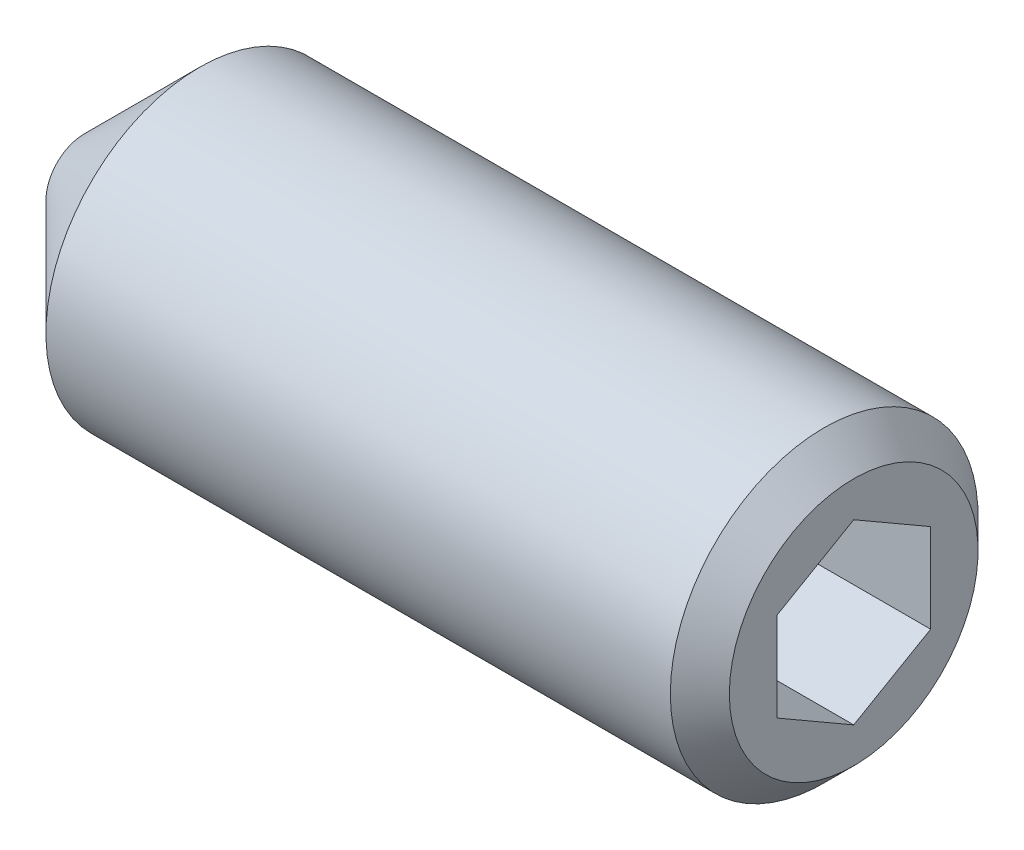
ISO-10303-21;
HEADER;
FILE_DESCRIPTION(('STEP AP214'),'2;1');
FILE_NAME('part.step','',(''),(''),'','','');
FILE_SCHEMA(('AUTOMOTIVE_DESIGN { 1 0 10303 214 1 1 1 1 }'));
ENDSEC;
DATA;
#1=APPLICATION_CONTEXT('core data for automotive mechanical design processes');
#2=APPLICATION_PROTOCOL_DEFINITION('international standard','automotive_design',2000,#1);
#3=PRODUCT_CONTEXT('',#1,'mechanical');
#4=PRODUCT('Part','Part','',(#3));
#5=PRODUCT_RELATED_PRODUCT_CATEGORY('part','',(#4));
#6=PRODUCT_DEFINITION_FORMATION('','',#4);
#7=PRODUCT_DEFINITION_CONTEXT('part definition',#1,'design');
#8=PRODUCT_DEFINITION('design','',#6,#7);
#9=PRODUCT_DEFINITION_SHAPE('','',#8);
#10=(LENGTH_UNIT() NAMED_UNIT(*) SI_UNIT(.MILLI.,.METRE.));
#11=(NAMED_UNIT(*) PLANE_ANGLE_UNIT() SI_UNIT($,.RADIAN.));
#12=(NAMED_UNIT(*) SI_UNIT($,.STERADIAN.) SOLID_ANGLE_UNIT());
#13=UNCERTAINTY_MEASURE_WITH_UNIT(LENGTH_MEASURE(1.E-05),#10,'distance_accuracy_value','');
#14=(GEOMETRIC_REPRESENTATION_CONTEXT(3) GLOBAL_UNCERTAINTY_ASSIGNED_CONTEXT((#13)) GLOBAL_UNIT_ASSIGNED_CONTEXT((#10,
#11,#12)) REPRESENTATION_CONTEXT('',''));
#15=CARTESIAN_POINT('',(0.,0.,0.));
#16=DIRECTION('',(0.,0.,1.));
#17=DIRECTION('',(1.,0.,0.));
#18=AXIS2_PLACEMENT_3D('',#15,#16,#17);
#19=CARTESIAN_POINT('',(15.0080000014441,0.,0.));
#20=DIRECTION('',(1.,0.,0.));
#21=DIRECTION('',(0.,0.,-1.));
#22=AXIS2_PLACEMENT_3D('',#19,#20,#21);
#23=CONICAL_SURFACE('',#22,2.32325748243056,1.0471975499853);
#24=CARTESIAN_POINT('',(13.6666666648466,-5.6843418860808E-11,0.));
#25=VERTEX_POINT('',#24);
#26=VERTEX_LOOP('',#25);
#27=FACE_BOUND('',#26,.T.);
#28=CARTESIAN_POINT('',(15.0000000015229,-1.15470053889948,1.9999999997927));
#29=CARTESIAN_POINT('',(14.9706955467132,-1.20544263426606,1.91211211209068));
#30=CARTESIAN_POINT('',(14.9440446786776,-1.25662273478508,1.82346557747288));
#31=CARTESIAN_POINT('',(14.897526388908,-1.35986908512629,1.64463765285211));
#32=CARTESIAN_POINT('',(14.8776754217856,-1.41193716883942,1.55445308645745));
#33=CARTESIAN_POINT('',(14.846775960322,-1.51542808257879,1.37520156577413));
#34=CARTESIAN_POINT('',(14.8355217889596,-1.56683499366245,1.28616218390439));
#35=CARTESIAN_POINT('',(14.8220891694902,-1.66989057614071,1.10766467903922));
#36=CARTESIAN_POINT('',(14.8198995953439,-1.7215388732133,1.01820720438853));
#37=CARTESIAN_POINT('',(14.8244662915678,-1.81803817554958,0.851065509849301));
#38=CARTESIAN_POINT('',(14.8301012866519,-1.86290366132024,0.773356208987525));
#39=CARTESIAN_POINT('',(14.8479573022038,-1.95234234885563,0.618443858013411));
#40=CARTESIAN_POINT('',(14.8601844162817,-1.99691524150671,0.541241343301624));
#41=CARTESIAN_POINT('',(14.8907498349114,-2.0865381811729,0.38600985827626));
#42=CARTESIAN_POINT('',(14.9092176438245,-2.13157689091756,0.308000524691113));
#43=CARTESIAN_POINT('',(14.9511317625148,-2.22098275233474,0.153145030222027));
#44=CARTESIAN_POINT('',(14.9745682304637,-2.26535104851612,0.0762968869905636));
#45=CARTESIAN_POINT('',(15.0000000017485,-2.30940107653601,3.8535877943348E-10));
#46=B_SPLINE_CURVE_WITH_KNOTS('',3,(#28,#29,#30,#31,#32,#33,#34,#35,#36,#37,#38,#39,#40,#41,#42,
#43,#44,#45),.UNSPECIFIED.,.F.,.F.,(4,2,2,2,2,2,2,2,4),(0.,0.31701601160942,0.634793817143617,
0.944707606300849,1.2542408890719,1.52370778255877,1.79342419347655,2.06912162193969,
2.34427797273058),.UNSPECIFIED.);
#47=CARTESIAN_POINT('',(15.0000000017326,-1.15470053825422,1.99999999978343));
#48=VERTEX_POINT('',#47);
#49=CARTESIAN_POINT('',(15.0000000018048,-2.30940107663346,2.16565162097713E-10));
#50=VERTEX_POINT('',#49);
#51=EDGE_CURVE('E20',#48,#50,#46,.T.);
#52=ORIENTED_EDGE('',*,*,#51,.T.);
#53=CARTESIAN_POINT('',(15.0000000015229,-2.30940107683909,-5.54175566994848E-10));
#54=CARTESIAN_POINT('',(14.9706955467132,-2.25865898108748,-0.0878878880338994));
#55=CARTESIAN_POINT('',(14.9440446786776,-2.20747888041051,-0.17653442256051));
#56=CARTESIAN_POINT('',(14.897526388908,-2.10423252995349,-0.355362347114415));
#57=CARTESIAN_POINT('',(14.8776754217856,-2.05216444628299,-0.445546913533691));
#58=CARTESIAN_POINT('',(14.846775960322,-1.94867353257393,-0.624798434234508));
#59=CARTESIAN_POINT('',(14.8355217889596,-1.8972666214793,-0.713837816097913));
#60=CARTESIAN_POINT('',(14.8220891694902,-1.79421103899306,-0.892335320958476));
#61=CARTESIAN_POINT('',(14.8198995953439,-1.74256274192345,-0.981792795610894));
#62=CARTESIAN_POINT('',(14.8244662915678,-1.64606343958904,-1.1489344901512));
#63=CARTESIAN_POINT('',(14.8301012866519,-1.60119795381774,-1.22664379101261));
#64=CARTESIAN_POINT('',(14.8479573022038,-1.51175926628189,-1.38155614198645));
#65=CARTESIAN_POINT('',(14.8601844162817,-1.46718637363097,-1.45875865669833));
#66=CARTESIAN_POINT('',(14.8907498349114,-1.37756343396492,-1.61399014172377));
#67=CARTESIAN_POINT('',(14.9092176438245,-1.33252472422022,-1.6919994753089));
#68=CARTESIAN_POINT('',(14.9511317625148,-1.24311886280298,-1.84685496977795));
#69=CARTESIAN_POINT('',(14.9745682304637,-1.19875056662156,-1.92370311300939));
#70=CARTESIAN_POINT('',(15.0000000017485,-1.15470053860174,-1.99999999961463));
#71=B_SPLINE_CURVE_WITH_KNOTS('',3,(#53,#54,#55,#56,#57,#58,#59,#60,#61,#62,#63,#64,#65,#66,#67,
#68,#69,#70),.UNSPECIFIED.,.F.,.F.,(4,2,2,2,2,2,2,2,4),(0.,0.31701601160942,0.634793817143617,
0.94470760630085,1.2542408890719,1.52370778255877,1.79342419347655,2.06912162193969,
2.34427797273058),.UNSPECIFIED.);
#72=CARTESIAN_POINT('',(15.0000000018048,-1.15470053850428,-1.99999999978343));
#73=VERTEX_POINT('',#72);
#74=EDGE_CURVE('E110',#50,#73,#71,.T.);
#75=ORIENTED_EDGE('',*,*,#74,.T.);
#76=CARTESIAN_POINT('',(15.0000000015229,-1.15470053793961,-2.00000000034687));
#77=CARTESIAN_POINT('',(14.9706955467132,-1.05321634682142,-2.00000000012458));
#78=CARTESIAN_POINT('',(14.9440446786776,-0.95085614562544,-2.00000000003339));
#79=CARTESIAN_POINT('',(14.897526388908,-0.7443634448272,-1.99999999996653));
#80=CARTESIAN_POINT('',(14.8776754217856,-0.640227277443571,-1.99999999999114));
#81=CARTESIAN_POINT('',(14.846775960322,-0.433245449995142,-2.00000000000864));
#82=CARTESIAN_POINT('',(14.8355217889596,-0.330431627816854,-2.0000000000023));
#83=CARTESIAN_POINT('',(14.8220891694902,-0.124320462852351,-1.9999999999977));
#84=CARTESIAN_POINT('',(14.8198995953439,-0.0210238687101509,-1.99999999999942));
#85=CARTESIAN_POINT('',(14.8244662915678,0.171974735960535,-2.0000000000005));
#86=CARTESIAN_POINT('',(14.8301012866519,0.261705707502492,-2.00000000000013));
#87=CARTESIAN_POINT('',(14.8479573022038,0.440583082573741,-1.99999999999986));
#88=CARTESIAN_POINT('',(14.8601844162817,0.52972886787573,-1.99999999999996));
#89=CARTESIAN_POINT('',(14.8907498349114,0.708974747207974,-2.00000000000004));
#90=CARTESIAN_POINT('',(14.9092176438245,0.799052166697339,-2.00000000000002));
#91=CARTESIAN_POINT('',(14.9511317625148,0.977863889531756,-1.99999999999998));
#92=CARTESIAN_POINT('',(14.9745682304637,1.06660048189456,-1.99999999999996));
#93=CARTESIAN_POINT('',(15.0000000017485,1.15470053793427,-2.));
#94=B_SPLINE_CURVE_WITH_KNOTS('',3,(#76,#77,#78,#79,#80,#81,#82,#83,#84,#85,#86,#87,#88,#89,#90,
#91,#92,#93),.UNSPECIFIED.,.F.,.F.,(4,2,2,2,2,2,2,2,4),(0.,0.317016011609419,0.634793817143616,
0.944707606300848,1.2542408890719,1.52370778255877,1.79342419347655,2.06912162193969,
2.34427797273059),.UNSPECIFIED.);
#95=CARTESIAN_POINT('',(15.0000000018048,1.15470053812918,-1.99999999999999));
#96=VERTEX_POINT('',#95);
#97=EDGE_CURVE('E106',#73,#96,#94,.T.);
#98=ORIENTED_EDGE('',*,*,#97,.T.);
#99=CARTESIAN_POINT('',(15.0000000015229,1.15470053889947,-1.99999999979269));
#100=CARTESIAN_POINT('',(14.9706955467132,1.20544263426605,-1.91211211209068));
#101=CARTESIAN_POINT('',(14.9440446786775,1.25662273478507,-1.82346557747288));
#102=CARTESIAN_POINT('',(14.897526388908,1.35986908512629,-1.64463765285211));
#103=CARTESIAN_POINT('',(14.8776754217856,1.41193716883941,-1.55445308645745));
#104=CARTESIAN_POINT('',(14.846775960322,1.51542808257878,-1.37520156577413));
#105=CARTESIAN_POINT('',(14.8355217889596,1.56683499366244,-1.28616218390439));
#106=CARTESIAN_POINT('',(14.8220891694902,1.6698905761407,-1.10766467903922));
#107=CARTESIAN_POINT('',(14.8198995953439,1.7215388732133,-1.01820720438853));
#108=CARTESIAN_POINT('',(14.8244662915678,1.81803817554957,-0.851065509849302));
#109=CARTESIAN_POINT('',(14.8301012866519,1.86290366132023,-0.773356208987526));
#110=CARTESIAN_POINT('',(14.8479573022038,1.95234234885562,-0.618443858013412));
#111=CARTESIAN_POINT('',(14.8601844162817,1.9969152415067,-0.541241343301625));
#112=CARTESIAN_POINT('',(14.8907498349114,2.08653818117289,-0.38600985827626));
#113=CARTESIAN_POINT('',(14.9092176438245,2.13157689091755,-0.308000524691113));
#114=CARTESIAN_POINT('',(14.9511317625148,2.22098275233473,-0.153145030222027));
#115=CARTESIAN_POINT('',(14.9745682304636,2.26535104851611,-0.0762968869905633));
#116=CARTESIAN_POINT('',(15.0000000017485,2.309401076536,-3.85358396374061E-10));
#117=B_SPLINE_CURVE_WITH_KNOTS('',3,(#99,#100,#101,#102,#103,#104,#105,#106,#107,#108,#109,#110,
#111,#112,#113,#114,#115,#116),.UNSPECIFIED.,.F.,.F.,(4,2,2,2,2,2,2,2,4),(0.,0.317016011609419,
0.634793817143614,0.944707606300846,1.25424088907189,1.52370778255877,1.79342419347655,
2.06912162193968,2.34427797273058),.UNSPECIFIED.);
#118=CARTESIAN_POINT('',(15.0000000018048,2.30940107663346,-2.16569087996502E-10));
#119=VERTEX_POINT('',#118);
#120=EDGE_CURVE('E102',#96,#119,#117,.T.);
#121=ORIENTED_EDGE('',*,*,#120,.T.);
#122=CARTESIAN_POINT('',(15.0000000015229,2.30940107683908,5.54171780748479E-10));
#123=CARTESIAN_POINT('',(14.9706955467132,2.25865898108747,0.0878878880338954));
#124=CARTESIAN_POINT('',(14.9440446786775,2.20747888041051,0.176534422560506));
#125=CARTESIAN_POINT('',(14.897526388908,2.10423252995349,0.35536234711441));
#126=CARTESIAN_POINT('',(14.8776754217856,2.05216444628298,0.445546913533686));
#127=CARTESIAN_POINT('',(14.846775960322,1.94867353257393,0.624798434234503));
#128=CARTESIAN_POINT('',(14.8355217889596,1.89726662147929,0.713837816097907));
#129=CARTESIAN_POINT('',(14.8220891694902,1.79421103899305,0.892335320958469));
#130=CARTESIAN_POINT('',(14.8198995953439,1.74256274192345,0.981792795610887));
#131=CARTESIAN_POINT('',(14.8244662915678,1.64606343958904,1.14893449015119));
#132=CARTESIAN_POINT('',(14.8301012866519,1.60119795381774,1.2266437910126));
#133=CARTESIAN_POINT('',(14.8479573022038,1.51175926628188,1.38155614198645));
#134=CARTESIAN_POINT('',(14.8601844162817,1.46718637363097,1.45875865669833));
#135=CARTESIAN_POINT('',(14.8907498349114,1.37756343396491,1.61399014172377));
#136=CARTESIAN_POINT('',(14.9092176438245,1.33252472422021,1.6919994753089));
#137=CARTESIAN_POINT('',(14.9511317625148,1.24311886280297,1.84685496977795));
#138=CARTESIAN_POINT('',(14.9745682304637,1.19875056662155,1.92370311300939));
#139=CARTESIAN_POINT('',(15.0000000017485,1.15470053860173,1.99999999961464));
#140=B_SPLINE_CURVE_WITH_KNOTS('',3,(#122,#123,#124,#125,#126,#127,#128,#129,#130,#131,#132,
#133,#134,#135,#136,#137,#138,#139),.UNSPECIFIED.,.F.,.F.,(4,2,2,2,2,2,2,2,4),(0.,
0.31701601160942,0.634793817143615,0.944707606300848,1.25424088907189,1.52370778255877,
1.79342419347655,2.06912162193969,2.34427797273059),.UNSPECIFIED.);
#141=CARTESIAN_POINT('',(15.0000000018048,1.15470053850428,1.99999999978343));
#142=VERTEX_POINT('',#141);
#143=EDGE_CURVE('E85',#119,#142,#140,.T.);
#144=ORIENTED_EDGE('',*,*,#143,.T.);
#145=CARTESIAN_POINT('',(15.0000000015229,1.1547005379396,2.00000000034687));
#146=CARTESIAN_POINT('',(14.9706955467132,1.05321634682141,2.00000000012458));
#147=CARTESIAN_POINT('',(14.9440446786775,0.950856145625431,2.00000000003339));
#148=CARTESIAN_POINT('',(14.897526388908,0.744363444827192,1.99999999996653));
#149=CARTESIAN_POINT('',(14.8776754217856,0.640227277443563,1.99999999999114));
#150=CARTESIAN_POINT('',(14.846775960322,0.433245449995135,2.00000000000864));
#151=CARTESIAN_POINT('',(14.8355217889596,0.330431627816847,2.0000000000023));
#152=CARTESIAN_POINT('',(14.8220891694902,0.124320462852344,1.9999999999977));
#153=CARTESIAN_POINT('',(14.8198995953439,0.0210238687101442,1.99999999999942));
#154=CARTESIAN_POINT('',(14.8244662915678,-0.171974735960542,2.0000000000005));
#155=CARTESIAN_POINT('',(14.8301012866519,-0.261705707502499,2.00000000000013));
#156=CARTESIAN_POINT('',(14.8479573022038,-0.440583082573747,1.99999999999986));
#157=CARTESIAN_POINT('',(14.8601844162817,-0.529728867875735,1.99999999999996));
#158=CARTESIAN_POINT('',(14.8907498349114,-0.70897474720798,2.00000000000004));
#159=CARTESIAN_POINT('',(14.9092176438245,-0.799052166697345,2.00000000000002));
#160=CARTESIAN_POINT('',(14.9511317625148,-0.977863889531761,1.99999999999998));
#161=CARTESIAN_POINT('',(14.9745682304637,-1.06660048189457,1.99999999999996));
#162=CARTESIAN_POINT('',(15.0000000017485,-1.15470053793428,2.));
#163=B_SPLINE_CURVE_WITH_KNOTS('',3,(#145,#146,#147,#148,#149,#150,#151,#152,#153,#154,#155,
#156,#157,#158,#159,#160,#161,#162),.UNSPECIFIED.,.F.,.F.,(4,2,2,2,2,2,2,2,4),(0.,
0.317016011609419,0.634793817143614,0.944707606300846,1.25424088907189,1.52370778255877,
1.79342419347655,2.06912162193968,2.34427797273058),.UNSPECIFIED.);
#164=EDGE_CURVE('E83',#142,#48,#163,.T.);
#165=ORIENTED_EDGE('',*,*,#164,.T.);
#166=EDGE_LOOP('',(#52,#75,#98,#121,#144,#165));
#167=FACE_BOUND('',#166,.T.);
#168=ADVANCED_FACE('F16',(#27,#167),#23,.F.);
#169=CARTESIAN_POINT('',(20.,-1.15470053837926,1.99999999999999));
#170=DIRECTION('',(0.,-0.86602540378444,0.499999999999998));
#171=DIRECTION('',(0.,-0.499999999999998,-0.86602540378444));
#172=AXIS2_PLACEMENT_3D('',#169,#170,#171);
#173=PLANE('',#172);
#174=DIRECTION('',(1.,0.,0.));
#175=VECTOR('',#174,1.);
#176=CARTESIAN_POINT('',(20.,-1.15470053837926,2.));
#177=LINE('',#176,#175);
#178=CARTESIAN_POINT('',(20.,-1.15470053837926,2.));
#179=VERTEX_POINT('',#178);
#180=EDGE_CURVE('E76',#48,#179,#177,.T.);
#181=ORIENTED_EDGE('',*,*,#180,.T.);
#182=DIRECTION('',(0.,-0.499999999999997,-0.86602540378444));
#183=VECTOR('',#182,1.);
#184=CARTESIAN_POINT('',(20.,-1.15470053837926,1.99999999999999));
#185=LINE('',#184,#183);
#186=CARTESIAN_POINT('',(20.,-2.3094010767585,0.));
#187=VERTEX_POINT('',#186);
#188=EDGE_CURVE('E87',#179,#187,#185,.T.);
#189=ORIENTED_EDGE('',*,*,#188,.T.);
#190=DIRECTION('',(1.,0.,0.));
#191=VECTOR('',#190,1.);
#192=CARTESIAN_POINT('',(20.,-2.3094010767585,0.));
#193=LINE('',#192,#191);
#194=EDGE_CURVE('E79',#187,#50,#193,.F.);
#195=ORIENTED_EDGE('',*,*,#194,.T.);
#196=ORIENTED_EDGE('',*,*,#51,.F.);
#197=EDGE_LOOP('',(#181,#189,#195,#196));
#198=FACE_BOUND('',#197,.T.);
#199=ADVANCED_FACE('F74',(#198),#173,.F.);
#200=CARTESIAN_POINT('',(20.,-2.3094010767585,0.));
#201=DIRECTION('',(0.,-0.866025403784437,-0.500000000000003));
#202=DIRECTION('',(0.,0.500000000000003,-0.866025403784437));
#203=AXIS2_PLACEMENT_3D('',#200,#201,#202);
#204=PLANE('',#203);
#205=ORIENTED_EDGE('',*,*,#194,.F.);
#206=DIRECTION('',(0.,0.500000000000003,-0.866025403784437));
#207=VECTOR('',#206,1.);
#208=CARTESIAN_POINT('',(20.,-2.3094010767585,0.));
#209=LINE('',#208,#207);
#210=CARTESIAN_POINT('',(20.,-1.15470053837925,-2.));
#211=VERTEX_POINT('',#210);
#212=EDGE_CURVE('E117',#187,#211,#209,.T.);
#213=ORIENTED_EDGE('',*,*,#212,.T.);
#214=DIRECTION('',(-1.,0.,0.));
#215=VECTOR('',#214,1.);
#216=CARTESIAN_POINT('',(20.,-1.15470053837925,-2.));
#217=LINE('',#216,#215);
#218=EDGE_CURVE('E107',#211,#73,#217,.T.);
#219=ORIENTED_EDGE('',*,*,#218,.T.);
#220=ORIENTED_EDGE('',*,*,#74,.F.);
#221=EDGE_LOOP('',(#205,#213,#219,#220));
#222=FACE_BOUND('',#221,.T.);
#223=ADVANCED_FACE('F162',(#222),#204,.F.);
#224=CARTESIAN_POINT('',(20.,-1.15470053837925,-2.));
#225=DIRECTION('',(0.,0.,-1.));
#226=DIRECTION('',(-1.,0.,0.));
#227=AXIS2_PLACEMENT_3D('',#224,#225,#226);
#228=PLANE('',#227);
#229=ORIENTED_EDGE('',*,*,#218,.F.);
#230=DIRECTION('',(0.,1.,0.));
#231=VECTOR('',#230,1.);
#232=CARTESIAN_POINT('',(20.,0.,-2.));
#233=LINE('',#232,#231);
#234=CARTESIAN_POINT('',(20.,1.15470053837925,-1.99999999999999));
#235=VERTEX_POINT('',#234);
#236=EDGE_CURVE('E119',#211,#235,#233,.T.);
#237=ORIENTED_EDGE('',*,*,#236,.T.);
#238=DIRECTION('',(1.,0.,0.));
#239=VECTOR('',#238,1.);
#240=CARTESIAN_POINT('',(20.,1.15470053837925,-1.99999999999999));
#241=LINE('',#240,#239);
#242=EDGE_CURVE('E103',#235,#96,#241,.F.);
#243=ORIENTED_EDGE('',*,*,#242,.T.);
#244=ORIENTED_EDGE('',*,*,#97,.F.);
#245=EDGE_LOOP('',(#229,#237,#243,#244));
#246=FACE_BOUND('',#245,.T.);
#247=ADVANCED_FACE('F148',(#246),#228,.F.);
#248=CARTESIAN_POINT('',(20.,1.15470053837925,-1.99999999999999));
#249=DIRECTION('',(0.,0.86602540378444,-0.499999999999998));
#250=DIRECTION('',(0.,0.499999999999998,0.86602540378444));
#251=AXIS2_PLACEMENT_3D('',#248,#249,#250);
#252=PLANE('',#251);
#253=ORIENTED_EDGE('',*,*,#242,.F.);
#254=DIRECTION('',(0.,0.500000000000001,0.866025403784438));
#255=VECTOR('',#254,1.);
#256=CARTESIAN_POINT('',(20.,1.15470053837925,-1.99999999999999));
#257=LINE('',#256,#255);
#258=CARTESIAN_POINT('',(20.,2.3094010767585,0.));
#259=VERTEX_POINT('',#258);
#260=EDGE_CURVE('E113',#235,#259,#257,.T.);
#261=ORIENTED_EDGE('',*,*,#260,.T.);
#262=DIRECTION('',(1.,0.,0.));
#263=VECTOR('',#262,1.);
#264=CARTESIAN_POINT('',(20.,2.3094010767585,0.));
#265=LINE('',#264,#263);
#266=EDGE_CURVE('E96',#259,#119,#265,.F.);
#267=ORIENTED_EDGE('',*,*,#266,.T.);
#268=ORIENTED_EDGE('',*,*,#120,.F.);
#269=EDGE_LOOP('',(#253,#261,#267,#268));
#270=FACE_BOUND('',#269,.T.);
#271=ADVANCED_FACE('F144',(#270),#252,.F.);
#272=CARTESIAN_POINT('',(20.,2.30940107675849,0.));
#273=DIRECTION('',(0.,0.866025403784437,0.500000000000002));
#274=DIRECTION('',(0.,-0.500000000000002,0.866025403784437));
#275=AXIS2_PLACEMENT_3D('',#272,#273,#274);
#276=PLANE('',#275);
#277=ORIENTED_EDGE('',*,*,#266,.F.);
#278=DIRECTION('',(0.,-0.500000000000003,0.866025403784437));
#279=VECTOR('',#278,1.);
#280=CARTESIAN_POINT('',(20.,2.3094010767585,0.));
#281=LINE('',#280,#279);
#282=CARTESIAN_POINT('',(20.,1.15470053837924,2.));
#283=VERTEX_POINT('',#282);
#284=EDGE_CURVE('E38',#259,#283,#281,.T.);
#285=ORIENTED_EDGE('',*,*,#284,.T.);
#286=DIRECTION('',(1.,0.,0.));
#287=VECTOR('',#286,1.);
#288=CARTESIAN_POINT('',(20.,1.15470053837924,2.));
#289=LINE('',#288,#287);
#290=EDGE_CURVE('E88',#283,#142,#289,.F.);
#291=ORIENTED_EDGE('',*,*,#290,.T.);
#292=ORIENTED_EDGE('',*,*,#143,.F.);
#293=EDGE_LOOP('',(#277,#285,#291,#292));
#294=FACE_BOUND('',#293,.T.);
#295=ADVANCED_FACE('F139',(#294),#276,.F.);
#296=CARTESIAN_POINT('',(20.,1.15470053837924,2.));
#297=DIRECTION('',(0.,0.,1.));
#298=DIRECTION('',(1.,0.,0.));
#299=AXIS2_PLACEMENT_3D('',#296,#297,#298);
#300=PLANE('',#299);
#301=ORIENTED_EDGE('',*,*,#290,.F.);
#302=DIRECTION('',(0.,1.,0.));
#303=VECTOR('',#302,1.);
#304=CARTESIAN_POINT('',(20.,0.,2.));
#305=LINE('',#304,#303);
#306=EDGE_CURVE('E92',#283,#179,#305,.F.);
#307=ORIENTED_EDGE('',*,*,#306,.T.);
#308=ORIENTED_EDGE('',*,*,#180,.F.);
#309=ORIENTED_EDGE('',*,*,#164,.F.);
#310=EDGE_LOOP('',(#301,#307,#308,#309));
#311=FACE_BOUND('',#310,.T.);
#312=ADVANCED_FACE('F90',(#311),#300,.F.);
#313=CARTESIAN_POINT('',(0.,2.,0.));
#314=DIRECTION('',(-1.,0.,0.));
#315=DIRECTION('',(0.,0.,1.));
#316=AXIS2_PLACEMENT_3D('',#313,#314,#315);
#317=PLANE('',#316);
#318=CARTESIAN_POINT('',(-1.30739863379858E-09,0.,0.));
#319=DIRECTION('',(1.,0.,0.));
#320=DIRECTION('',(0.,0.,-1.));
#321=AXIS2_PLACEMENT_3D('',#318,#319,#320);
#322=CIRCLE('',#321,1.00000000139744);
#323=CARTESIAN_POINT('',(-1.30739863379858E-09,0.,-1.00000000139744));
#324=VERTEX_POINT('',#323);
#325=EDGE_CURVE('E115',#324,#324,#322,.T.);
#326=ORIENTED_EDGE('',*,*,#325,.F.);
#327=EDGE_LOOP('',(#326));
#328=FACE_BOUND('',#327,.T.);
#329=ADVANCED_FACE('F138',(#328),#317,.T.);
#330=CARTESIAN_POINT('',(20.,0.,0.));
#331=DIRECTION('',(-1.,0.,0.));
#332=DIRECTION('',(0.,0.,1.));
#333=AXIS2_PLACEMENT_3D('',#330,#331,#332);
#334=PLANE('',#333);
#335=ORIENTED_EDGE('',*,*,#284,.F.);
#336=ORIENTED_EDGE('',*,*,#260,.F.);
#337=ORIENTED_EDGE('',*,*,#236,.F.);
#338=ORIENTED_EDGE('',*,*,#212,.F.);
#339=ORIENTED_EDGE('',*,*,#188,.F.);
#340=ORIENTED_EDGE('',*,*,#306,.F.);
#341=EDGE_LOOP('',(#335,#336,#337,#338,#339,#340));
#342=FACE_BOUND('',#341,.T.);
#343=CARTESIAN_POINT('',(20.0000000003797,0.,0.));
#344=DIRECTION('',(-1.,0.,0.));
#345=DIRECTION('',(0.,0.,1.));
#346=AXIS2_PLACEMENT_3D('',#343,#344,#345);
#347=CIRCLE('',#346,3.23318750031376);
#348=CARTESIAN_POINT('',(20.0000000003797,0.,3.23318750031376));
#349=VERTEX_POINT('',#348);
#350=EDGE_CURVE('E122',#349,#349,#347,.T.);
#351=ORIENTED_EDGE('',*,*,#350,.F.);
#352=EDGE_LOOP('',(#351));
#353=FACE_BOUND('',#352,.T.);
#354=ADVANCED_FACE('F187',(#342,#353),#334,.F.);
#355=CARTESIAN_POINT('',(3.00000000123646,0.,0.));
#356=DIRECTION('',(1.,0.,0.));
#357=DIRECTION('',(0.,0.,-1.));
#358=AXIS2_PLACEMENT_3D('',#355,#356,#357);
#359=CONICAL_SURFACE('',#358,3.99999999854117,0.785398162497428);
#360=CARTESIAN_POINT('',(3.,0.,0.));
#361=DIRECTION('',(1.,0.,0.));
#362=DIRECTION('',(0.,1.,0.));
#363=AXIS2_PLACEMENT_3D('',#360,#361,#362);
#364=CIRCLE('',#363,4.);
#365=CARTESIAN_POINT('',(3.,0.,-3.99999999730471));
#366=VERTEX_POINT('',#365);
#367=EDGE_CURVE('E29',#366,#366,#364,.T.);
#368=CARTESIAN_POINT('',(3.,0.,-3.99999999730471));
#369=CARTESIAN_POINT('',(2.96874999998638,0.,-3.96874999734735));
#370=CARTESIAN_POINT('',(2.93749999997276,0.,-3.93749999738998));
#371=CARTESIAN_POINT('',(2.87499999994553,0.,-3.87499999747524));
#372=CARTESIAN_POINT('',(2.84374999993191,0.,-3.84374999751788));
#373=CARTESIAN_POINT('',(2.78124999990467,0.,-3.78124999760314));
#374=CARTESIAN_POINT('',(2.74999999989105,0.,-3.74999999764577));
#375=CARTESIAN_POINT('',(2.68749999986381,0.,-3.68749999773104));
#376=CARTESIAN_POINT('',(2.65624999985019,0.,-3.65624999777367));
#377=CARTESIAN_POINT('',(2.59374999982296,0.,-3.59374999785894));
#378=CARTESIAN_POINT('',(2.56249999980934,0.,-3.56249999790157));
#379=CARTESIAN_POINT('',(2.4999999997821,0.,-3.49999999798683));
#380=CARTESIAN_POINT('',(2.46874999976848,0.,-3.46874999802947));
#381=CARTESIAN_POINT('',(2.40624999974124,0.,-3.40624999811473));
#382=CARTESIAN_POINT('',(2.37499999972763,0.,-3.37499999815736));
#383=CARTESIAN_POINT('',(2.31249999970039,0.,-3.31249999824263));
#384=CARTESIAN_POINT('',(2.28124999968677,0.,-3.28124999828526));
#385=CARTESIAN_POINT('',(2.21874999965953,0.,-3.21874999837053));
#386=CARTESIAN_POINT('',(2.18749999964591,0.,-3.18749999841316));
#387=CARTESIAN_POINT('',(2.12499999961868,0.,-3.12499999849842));
#388=CARTESIAN_POINT('',(2.09374999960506,0.,-3.09374999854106));
#389=CARTESIAN_POINT('',(2.03124999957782,0.,-3.03124999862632));
#390=CARTESIAN_POINT('',(1.9999999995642,0.,-2.99999999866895));
#391=CARTESIAN_POINT('',(1.93749999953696,0.,-2.93749999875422));
#392=CARTESIAN_POINT('',(1.90624999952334,0.,-2.90624999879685));
#393=CARTESIAN_POINT('',(1.84374999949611,0.,-2.84374999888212));
#394=CARTESIAN_POINT('',(1.81249999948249,0.,-2.81249999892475));
#395=CARTESIAN_POINT('',(1.74999999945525,0.,-2.74999999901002));
#396=CARTESIAN_POINT('',(1.71874999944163,0.,-2.71874999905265));
#397=CARTESIAN_POINT('',(1.65624999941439,0.,-2.65624999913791));
#398=CARTESIAN_POINT('',(1.62499999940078,0.,-2.62499999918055));
#399=CARTESIAN_POINT('',(1.56249999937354,0.,-2.56249999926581));
#400=CARTESIAN_POINT('',(1.53124999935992,0.,-2.53124999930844));
#401=CARTESIAN_POINT('',(1.46874999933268,0.,-2.46874999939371));
#402=CARTESIAN_POINT('',(1.43749999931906,0.,-2.43749999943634));
#403=CARTESIAN_POINT('',(1.37499999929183,0.,-2.37499999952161));
#404=CARTESIAN_POINT('',(1.34374999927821,0.,-2.34374999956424));
#405=CARTESIAN_POINT('',(1.28124999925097,0.,-2.2812499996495));
#406=CARTESIAN_POINT('',(1.24999999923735,0.,-2.24999999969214));
#407=CARTESIAN_POINT('',(1.18749999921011,0.,-2.1874999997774));
#408=CARTESIAN_POINT('',(1.15624999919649,0.,-2.15624999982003));
#409=CARTESIAN_POINT('',(1.09374999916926,0.,-2.0937499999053));
#410=CARTESIAN_POINT('',(1.06249999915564,0.,-2.06249999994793));
#411=CARTESIAN_POINT('',(0.999999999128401,0.,-2.0000000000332));
#412=CARTESIAN_POINT('',(0.968749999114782,0.,-1.96875000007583));
#413=CARTESIAN_POINT('',(0.906249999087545,0.,-1.90625000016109));
#414=CARTESIAN_POINT('',(0.874999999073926,0.,-1.87500000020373));
#415=CARTESIAN_POINT('',(0.812499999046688,0.,-1.81250000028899));
#416=CARTESIAN_POINT('',(0.78124999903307,0.,-1.78125000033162));
#417=CARTESIAN_POINT('',(0.718749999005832,0.,-1.71875000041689));
#418=CARTESIAN_POINT('',(0.687499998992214,0.,-1.68750000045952));
#419=CARTESIAN_POINT('',(0.624999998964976,0.,-1.62500000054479));
#420=CARTESIAN_POINT('',(0.593749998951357,0.,-1.59375000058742));
#421=CARTESIAN_POINT('',(0.53124999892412,0.,-1.53125000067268));
#422=CARTESIAN_POINT('',(0.499999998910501,0.,-1.50000000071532));
#423=CARTESIAN_POINT('',(0.437499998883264,0.,-1.43750000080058));
#424=CARTESIAN_POINT('',(0.406249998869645,0.,-1.40625000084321));
#425=CARTESIAN_POINT('',(0.343749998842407,0.,-1.34375000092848));
#426=CARTESIAN_POINT('',(0.312499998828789,0.,-1.31250000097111));
#427=CARTESIAN_POINT('',(0.249999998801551,0.,-1.25000000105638));
#428=CARTESIAN_POINT('',(0.218749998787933,0.,-1.21875000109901));
#429=CARTESIAN_POINT('',(0.156249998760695,0.,-1.15625000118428));
#430=CARTESIAN_POINT('',(0.124999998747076,0.,-1.12500000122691));
#431=CARTESIAN_POINT('',(0.0624999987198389,0.,-1.06250000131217));
#432=CARTESIAN_POINT('',(0.0312499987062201,0.,-1.03125000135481));
#433=CARTESIAN_POINT('',(-1.30739863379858E-09,0.,-1.00000000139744));
#434=B_SPLINE_CURVE_WITH_KNOTS('',3,(#368,#369,#370,#371,#372,#373,#374,#375,#376,#377,#378,
#379,#380,#381,#382,#383,#384,#385,#386,#387,#388,#389,#390,#391,#392,#393,#394,#395,#396,#397,
#398,#399,#400,#401,#402,#403,#404,#405,#406,#407,#408,#409,#410,#411,#412,#413,#414,#415,#416,
#417,#418,#419,#420,#421,#422,#423,#424,#425,#426,#427,#428,#429,#430,#431,#432,#433),
.UNSPECIFIED.,.F.,.F.,(4,2,2,2,2,2,2,2,2,2,2,2,2,2,2,2,2,2,2,2,2,2,2,2,2,2,2,2,2,2,2,2,4),(0.,
0.13258252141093,0.26516504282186,0.39774756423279,0.53033008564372,0.66291260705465,
0.79549512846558,0.92807764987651,1.06066017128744,1.19324269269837,1.3258252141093,
1.45840773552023,1.59099025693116,1.72357277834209,1.85615529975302,1.98873782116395,
2.12132034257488,2.25390286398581,2.38648538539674,2.51906790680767,2.6516504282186,
2.78423294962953,2.91681547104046,3.04939799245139,3.18198051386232,3.31456303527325,
3.44714555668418,3.57972807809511,3.71231059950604,3.84489312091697,3.9774756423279,
4.11005816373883,4.24264068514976),.UNSPECIFIED.);
#435=EDGE_CURVE('BSEAM181',#366,#324,#434,.T.);
#436=ORIENTED_EDGE('',*,*,#367,.F.);
#437=ORIENTED_EDGE('',*,*,#325,.T.);
#438=ORIENTED_EDGE('',*,*,#435,.T.);
#439=ORIENTED_EDGE('',*,*,#435,.F.);
#440=EDGE_LOOP('',(#436,#438,#437,#439));
#441=FACE_BOUND('',#440,.T.);
#442=ADVANCED_FACE('F181',(#441),#359,.T.);
#443=CARTESIAN_POINT('',(19.2331874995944,0.,0.));
#444=DIRECTION('',(-1.,0.,0.));
#445=DIRECTION('',(0.,0.,1.));
#446=AXIS2_PLACEMENT_3D('',#443,#444,#445);
#447=CONICAL_SURFACE('',#446,3.99999999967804,0.78539816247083);
#448=ORIENTED_EDGE('',*,*,#350,.T.);
#449=EDGE_LOOP('',(#448));
#450=FACE_BOUND('',#449,.T.);
#451=CARTESIAN_POINT('',(19.2331875,0.,0.));
#452=DIRECTION('',(1.,0.,0.));
#453=DIRECTION('',(0.,1.,0.));
#454=AXIS2_PLACEMENT_3D('',#451,#452,#453);
#455=CIRCLE('',#454,4.);
#456=CARTESIAN_POINT('',(19.2331875,4.,0.));
#457=VERTEX_POINT('',#456);
#458=EDGE_CURVE('E11',#457,#457,#455,.F.);
#459=ORIENTED_EDGE('',*,*,#458,.F.);
#460=EDGE_LOOP('',(#459));
#461=FACE_BOUND('',#460,.T.);
#462=ADVANCED_FACE('F175',(#450,#461),#447,.T.);
#463=CARTESIAN_POINT('',(10.,0.,0.));
#464=DIRECTION('',(1.,0.,0.));
#465=DIRECTION('',(0.,1.,0.));
#466=AXIS2_PLACEMENT_3D('',#463,#464,#465);
#467=CYLINDRICAL_SURFACE('',#466,4.);
#468=ORIENTED_EDGE('',*,*,#458,.T.);
#469=EDGE_LOOP('',(#468));
#470=FACE_BOUND('',#469,.T.);
#471=ORIENTED_EDGE('',*,*,#367,.T.);
#472=EDGE_LOOP('',(#471));
#473=FACE_BOUND('',#472,.T.);
#474=ADVANCED_FACE('F173',(#470,#473),#467,.T.);
#475=CLOSED_SHELL('',(#168,#199,#223,#247,#271,#295,#312,#329,#354,#442,#462,#474));
#476=MANIFOLD_SOLID_BREP('B1',#475);
#477=ADVANCED_BREP_SHAPE_REPRESENTATION('',(#18,#476),#14);
#478=SHAPE_DEFINITION_REPRESENTATION(#9,#477);
ENDSEC;
END-ISO-10303-21;
